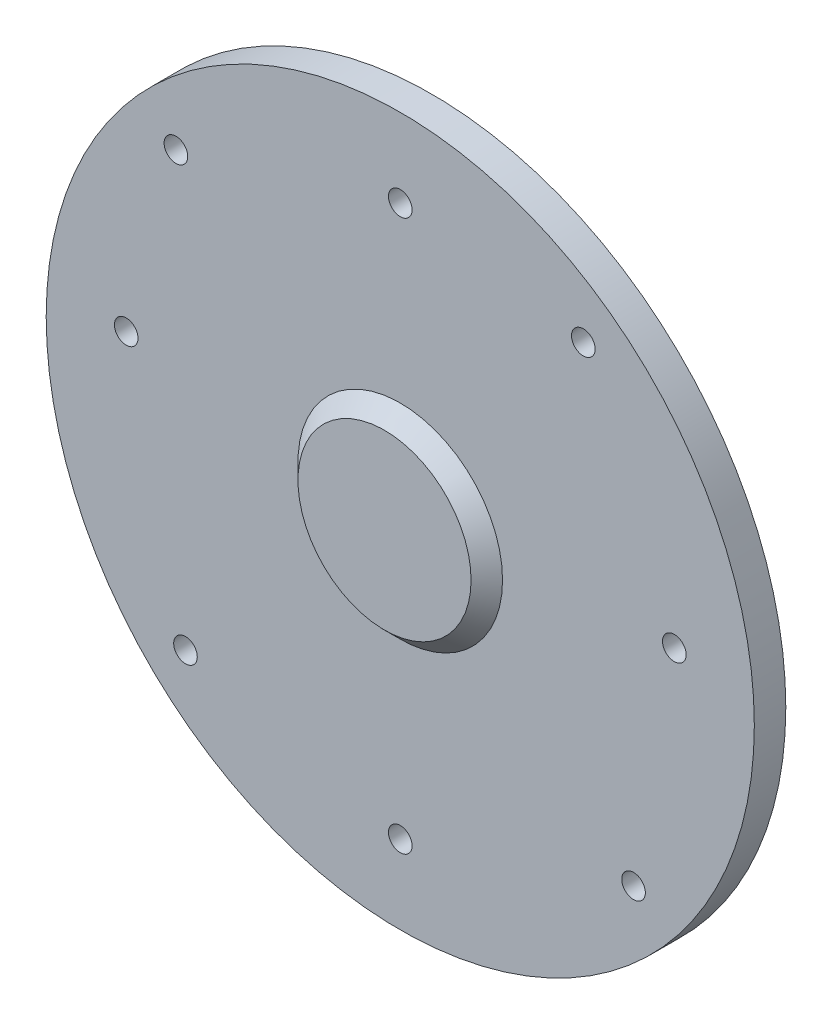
ISO-10303-21;
HEADER;
FILE_DESCRIPTION(('STEP AP214'),'2;1');
FILE_NAME('part.step','',(''),(''),'','','');
FILE_SCHEMA(('AUTOMOTIVE_DESIGN { 1 0 10303 214 1 1 1 1 }'));
ENDSEC;
DATA;
#1=APPLICATION_CONTEXT('core data for automotive mechanical design processes');
#2=APPLICATION_PROTOCOL_DEFINITION('international standard','automotive_design',2000,#1);
#3=PRODUCT_CONTEXT('',#1,'mechanical');
#4=PRODUCT('Part','Part','',(#3));
#5=PRODUCT_RELATED_PRODUCT_CATEGORY('part','',(#4));
#6=PRODUCT_DEFINITION_FORMATION('','',#4);
#7=PRODUCT_DEFINITION_CONTEXT('part definition',#1,'design');
#8=PRODUCT_DEFINITION('design','',#6,#7);
#9=PRODUCT_DEFINITION_SHAPE('','',#8);
#10=(LENGTH_UNIT() NAMED_UNIT(*) SI_UNIT(.MILLI.,.METRE.));
#11=(NAMED_UNIT(*) PLANE_ANGLE_UNIT() SI_UNIT($,.RADIAN.));
#12=(NAMED_UNIT(*) SI_UNIT($,.STERADIAN.) SOLID_ANGLE_UNIT());
#13=UNCERTAINTY_MEASURE_WITH_UNIT(LENGTH_MEASURE(1.E-05),#10,'distance_accuracy_value','');
#14=(GEOMETRIC_REPRESENTATION_CONTEXT(3) GLOBAL_UNCERTAINTY_ASSIGNED_CONTEXT((#13)) GLOBAL_UNIT_ASSIGNED_CONTEXT((#10,
#11,#12)) REPRESENTATION_CONTEXT('',''));
#15=CARTESIAN_POINT('',(0.,0.,0.));
#16=DIRECTION('',(0.,0.,1.));
#17=DIRECTION('',(1.,0.,0.));
#18=AXIS2_PLACEMENT_3D('',#15,#16,#17);
#19=CARTESIAN_POINT('',(0.,0.,-1.));
#20=DIRECTION('',(0.,0.,-1.));
#21=DIRECTION('',(-1.,0.,0.));
#22=AXIS2_PLACEMENT_3D('',#19,#20,#21);
#23=PLANE('',#22);
#24=CARTESIAN_POINT('',(0.,0.,-1.));
#25=DIRECTION('',(0.,0.,-1.));
#26=DIRECTION('',(-1.,0.,0.));
#27=AXIS2_PLACEMENT_3D('',#24,#25,#26);
#28=CIRCLE('',#27,5.5);
#29=CARTESIAN_POINT('',(-5.5,0.,-1.));
#30=VERTEX_POINT('',#29);
#31=EDGE_CURVE('E55',#30,#30,#28,.T.);
#32=ORIENTED_EDGE('',*,*,#31,.T.);
#33=EDGE_LOOP('',(#32));
#34=FACE_BOUND('',#33,.T.);
#35=CARTESIAN_POINT('',(0.,0.,-1.));
#36=DIRECTION('',(0.,0.,-1.));
#37=DIRECTION('',(-1.,0.,0.));
#38=AXIS2_PLACEMENT_3D('',#35,#36,#37);
#39=CIRCLE('',#38,5.);
#40=CARTESIAN_POINT('',(-5.,0.,-1.));
#41=VERTEX_POINT('',#40);
#42=EDGE_CURVE('E59',#41,#41,#39,.T.);
#43=ORIENTED_EDGE('',*,*,#42,.F.);
#44=EDGE_LOOP('',(#43));
#45=FACE_BOUND('',#44,.T.);
#46=ADVANCED_FACE('F32',(#34,#45),#23,.T.);
#47=CARTESIAN_POINT('',(0.,0.,0.));
#48=DIRECTION('',(0.,0.,1.));
#49=DIRECTION('',(1.,0.,0.));
#50=AXIS2_PLACEMENT_3D('',#47,#48,#49);
#51=PLANE('',#50);
#52=CARTESIAN_POINT('',(-13.6482975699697,-13.9274539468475,0.));
#53=DIRECTION('',(0.,0.,1.));
#54=DIRECTION('',(1.,0.,0.));
#55=AXIS2_PLACEMENT_3D('',#52,#53,#54);
#56=CIRCLE('',#55,0.75);
#57=CARTESIAN_POINT('',(-12.8982975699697,-13.9274539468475,0.));
#58=VERTEX_POINT('',#57);
#59=EDGE_CURVE('E109',#58,#58,#56,.T.);
#60=ORIENTED_EDGE('',*,*,#59,.T.);
#61=EDGE_LOOP('',(#60));
#62=FACE_BOUND('',#61,.T.);
#63=CARTESIAN_POINT('',(14.823494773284,-12.6694120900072,0.));
#64=DIRECTION('',(0.,0.,1.));
#65=DIRECTION('',(1.,0.,0.));
#66=AXIS2_PLACEMENT_3D('',#63,#64,#65);
#67=CIRCLE('',#66,0.75);
#68=CARTESIAN_POINT('',(15.573494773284,-12.6694120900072,0.));
#69=VERTEX_POINT('',#68);
#70=EDGE_CURVE('E103',#69,#69,#67,.T.);
#71=ORIENTED_EDGE('',*,*,#70,.T.);
#72=EDGE_LOOP('',(#71));
#73=FACE_BOUND('',#72,.T.);
#74=CARTESIAN_POINT('',(11.6318489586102,15.6508814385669,0.));
#75=DIRECTION('',(0.,0.,1.));
#76=DIRECTION('',(1.,0.,0.));
#77=AXIS2_PLACEMENT_3D('',#74,#75,#76);
#78=CIRCLE('',#77,0.75);
#79=CARTESIAN_POINT('',(12.3818489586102,15.6508814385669,0.));
#80=VERTEX_POINT('',#79);
#81=EDGE_CURVE('E97',#80,#80,#78,.T.);
#82=ORIENTED_EDGE('',*,*,#81,.T.);
#83=EDGE_LOOP('',(#82));
#84=FACE_BOUND('',#83,.T.);
#85=CARTESIAN_POINT('',(-14.2567540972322,13.3039453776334,0.));
#86=DIRECTION('',(0.,0.,1.));
#87=DIRECTION('',(1.,0.,0.));
#88=AXIS2_PLACEMENT_3D('',#85,#86,#87);
#89=CIRCLE('',#88,0.75);
#90=CARTESIAN_POINT('',(-13.5067540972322,13.3039453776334,0.));
#91=VERTEX_POINT('',#90);
#92=EDGE_CURVE('E91',#91,#91,#89,.T.);
#93=ORIENTED_EDGE('',*,*,#92,.T.);
#94=EDGE_LOOP('',(#93));
#95=FACE_BOUND('',#94,.T.);
#96=CARTESIAN_POINT('',(17.4149826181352,1.72289883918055,0.));
#97=DIRECTION('',(0.,0.,1.));
#98=DIRECTION('',(1.,0.,0.));
#99=AXIS2_PLACEMENT_3D('',#96,#97,#98);
#100=CIRCLE('',#99,0.750000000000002);
#101=CARTESIAN_POINT('',(18.1649826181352,1.72289883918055,0.));
#102=VERTEX_POINT('',#101);
#103=EDGE_CURVE('E85',#102,#102,#100,.T.);
#104=ORIENTED_EDGE('',*,*,#103,.T.);
#105=EDGE_LOOP('',(#104));
#106=FACE_BOUND('',#105,.T.);
#107=CARTESIAN_POINT('',(0.,-17.5,0.));
#108=DIRECTION('',(0.,0.,1.));
#109=DIRECTION('',(1.,0.,0.));
#110=AXIS2_PLACEMENT_3D('',#107,#108,#109);
#111=CIRCLE('',#110,0.75);
#112=CARTESIAN_POINT('',(0.75,-17.5,0.));
#113=VERTEX_POINT('',#112);
#114=EDGE_CURVE('E79',#113,#113,#111,.T.);
#115=ORIENTED_EDGE('',*,*,#114,.T.);
#116=EDGE_LOOP('',(#115));
#117=FACE_BOUND('',#116,.T.);
#118=CARTESIAN_POINT('',(-17.4149826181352,1.72289883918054,0.));
#119=DIRECTION('',(0.,0.,1.));
#120=DIRECTION('',(1.,0.,0.));
#121=AXIS2_PLACEMENT_3D('',#118,#119,#120);
#122=CIRCLE('',#121,0.750000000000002);
#123=CARTESIAN_POINT('',(-16.6649826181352,1.72289883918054,0.));
#124=VERTEX_POINT('',#123);
#125=EDGE_CURVE('E73',#124,#124,#122,.T.);
#126=ORIENTED_EDGE('',*,*,#125,.T.);
#127=EDGE_LOOP('',(#126));
#128=FACE_BOUND('',#127,.T.);
#129=CARTESIAN_POINT('',(0.,17.5,0.));
#130=DIRECTION('',(0.,0.,1.));
#131=DIRECTION('',(1.,0.,0.));
#132=AXIS2_PLACEMENT_3D('',#129,#130,#131);
#133=CIRCLE('',#132,0.75);
#134=CARTESIAN_POINT('',(0.75,17.5,0.));
#135=VERTEX_POINT('',#134);
#136=EDGE_CURVE('E67',#135,#135,#133,.T.);
#137=ORIENTED_EDGE('',*,*,#136,.T.);
#138=EDGE_LOOP('',(#137));
#139=FACE_BOUND('',#138,.T.);
#140=CARTESIAN_POINT('',(0.,0.,0.));
#141=DIRECTION('',(0.,0.,1.));
#142=DIRECTION('',(1.,0.,0.));
#143=AXIS2_PLACEMENT_3D('',#140,#141,#142);
#144=CIRCLE('',#143,22.5);
#145=CARTESIAN_POINT('',(22.5,0.,0.));
#146=VERTEX_POINT('',#145);
#147=EDGE_CURVE('E43',#146,#146,#144,.T.);
#148=ORIENTED_EDGE('',*,*,#147,.F.);
#149=EDGE_LOOP('',(#148));
#150=FACE_BOUND('',#149,.T.);
#151=CARTESIAN_POINT('',(0.,0.,0.));
#152=DIRECTION('',(0.,0.,1.));
#153=DIRECTION('',(1.,0.,0.));
#154=AXIS2_PLACEMENT_3D('',#151,#152,#153);
#155=CIRCLE('',#154,6.5);
#156=CARTESIAN_POINT('',(6.5,0.,0.));
#157=VERTEX_POINT('',#156);
#158=EDGE_CURVE('E10',#157,#157,#155,.F.);
#159=ORIENTED_EDGE('',*,*,#158,.F.);
#160=EDGE_LOOP('',(#159));
#161=FACE_BOUND('',#160,.T.);
#162=ADVANCED_FACE('F152',(#62,#73,#84,#95,#106,#117,#128,#139,#150,#161),#51,.F.);
#163=CARTESIAN_POINT('',(0.,0.,2.));
#164=DIRECTION('',(0.,0.,1.));
#165=DIRECTION('',(1.,0.,0.));
#166=AXIS2_PLACEMENT_3D('',#163,#164,#165);
#167=PLANE('',#166);
#168=CARTESIAN_POINT('',(-13.6482975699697,-13.9274539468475,2.));
#169=DIRECTION('',(0.,0.,1.));
#170=DIRECTION('',(1.,0.,0.));
#171=AXIS2_PLACEMENT_3D('',#168,#169,#170);
#172=CIRCLE('',#171,0.75);
#173=CARTESIAN_POINT('',(-12.8982975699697,-13.9274539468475,2.));
#174=VERTEX_POINT('',#173);
#175=EDGE_CURVE('E112',#174,#174,#172,.T.);
#176=ORIENTED_EDGE('',*,*,#175,.F.);
#177=EDGE_LOOP('',(#176));
#178=FACE_BOUND('',#177,.T.);
#179=CARTESIAN_POINT('',(14.823494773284,-12.6694120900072,2.));
#180=DIRECTION('',(0.,0.,1.));
#181=DIRECTION('',(1.,0.,0.));
#182=AXIS2_PLACEMENT_3D('',#179,#180,#181);
#183=CIRCLE('',#182,0.75);
#184=CARTESIAN_POINT('',(15.573494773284,-12.6694120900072,2.));
#185=VERTEX_POINT('',#184);
#186=EDGE_CURVE('E106',#185,#185,#183,.T.);
#187=ORIENTED_EDGE('',*,*,#186,.F.);
#188=EDGE_LOOP('',(#187));
#189=FACE_BOUND('',#188,.T.);
#190=CARTESIAN_POINT('',(11.6318489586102,15.6508814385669,2.));
#191=DIRECTION('',(0.,0.,1.));
#192=DIRECTION('',(1.,0.,0.));
#193=AXIS2_PLACEMENT_3D('',#190,#191,#192);
#194=CIRCLE('',#193,0.75);
#195=CARTESIAN_POINT('',(12.3818489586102,15.6508814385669,2.));
#196=VERTEX_POINT('',#195);
#197=EDGE_CURVE('E100',#196,#196,#194,.T.);
#198=ORIENTED_EDGE('',*,*,#197,.F.);
#199=EDGE_LOOP('',(#198));
#200=FACE_BOUND('',#199,.T.);
#201=CARTESIAN_POINT('',(-14.2567540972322,13.3039453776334,2.));
#202=DIRECTION('',(0.,0.,1.));
#203=DIRECTION('',(1.,0.,0.));
#204=AXIS2_PLACEMENT_3D('',#201,#202,#203);
#205=CIRCLE('',#204,0.75);
#206=CARTESIAN_POINT('',(-13.5067540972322,13.3039453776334,2.));
#207=VERTEX_POINT('',#206);
#208=EDGE_CURVE('E94',#207,#207,#205,.T.);
#209=ORIENTED_EDGE('',*,*,#208,.F.);
#210=EDGE_LOOP('',(#209));
#211=FACE_BOUND('',#210,.T.);
#212=CARTESIAN_POINT('',(17.4149826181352,1.72289883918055,2.));
#213=DIRECTION('',(0.,0.,1.));
#214=DIRECTION('',(1.,0.,0.));
#215=AXIS2_PLACEMENT_3D('',#212,#213,#214);
#216=CIRCLE('',#215,0.750000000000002);
#217=CARTESIAN_POINT('',(18.1649826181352,1.72289883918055,2.));
#218=VERTEX_POINT('',#217);
#219=EDGE_CURVE('E88',#218,#218,#216,.T.);
#220=ORIENTED_EDGE('',*,*,#219,.F.);
#221=EDGE_LOOP('',(#220));
#222=FACE_BOUND('',#221,.T.);
#223=CARTESIAN_POINT('',(0.,-17.5,2.));
#224=DIRECTION('',(0.,0.,1.));
#225=DIRECTION('',(1.,0.,0.));
#226=AXIS2_PLACEMENT_3D('',#223,#224,#225);
#227=CIRCLE('',#226,0.75);
#228=CARTESIAN_POINT('',(0.75,-17.5,2.));
#229=VERTEX_POINT('',#228);
#230=EDGE_CURVE('E82',#229,#229,#227,.T.);
#231=ORIENTED_EDGE('',*,*,#230,.F.);
#232=EDGE_LOOP('',(#231));
#233=FACE_BOUND('',#232,.T.);
#234=CARTESIAN_POINT('',(-17.4149826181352,1.72289883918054,2.));
#235=DIRECTION('',(0.,0.,1.));
#236=DIRECTION('',(1.,0.,0.));
#237=AXIS2_PLACEMENT_3D('',#234,#235,#236);
#238=CIRCLE('',#237,0.750000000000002);
#239=CARTESIAN_POINT('',(-16.6649826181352,1.72289883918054,2.));
#240=VERTEX_POINT('',#239);
#241=EDGE_CURVE('E76',#240,#240,#238,.T.);
#242=ORIENTED_EDGE('',*,*,#241,.F.);
#243=EDGE_LOOP('',(#242));
#244=FACE_BOUND('',#243,.T.);
#245=CARTESIAN_POINT('',(0.,17.5,2.));
#246=DIRECTION('',(0.,0.,1.));
#247=DIRECTION('',(1.,0.,0.));
#248=AXIS2_PLACEMENT_3D('',#245,#246,#247);
#249=CIRCLE('',#248,0.75);
#250=CARTESIAN_POINT('',(0.75,17.5,2.));
#251=VERTEX_POINT('',#250);
#252=EDGE_CURVE('E70',#251,#251,#249,.T.);
#253=ORIENTED_EDGE('',*,*,#252,.F.);
#254=EDGE_LOOP('',(#253));
#255=FACE_BOUND('',#254,.T.);
#256=CARTESIAN_POINT('',(0.,0.,2.));
#257=DIRECTION('',(0.,0.,1.));
#258=DIRECTION('',(1.,0.,0.));
#259=AXIS2_PLACEMENT_3D('',#256,#257,#258);
#260=CIRCLE('',#259,22.5);
#261=CARTESIAN_POINT('',(22.5,0.,2.));
#262=VERTEX_POINT('',#261);
#263=EDGE_CURVE('E39',#262,#262,#260,.T.);
#264=ORIENTED_EDGE('',*,*,#263,.T.);
#265=EDGE_LOOP('',(#264));
#266=FACE_BOUND('',#265,.T.);
#267=CARTESIAN_POINT('',(0.,0.,2.));
#268=DIRECTION('',(0.,0.,1.));
#269=DIRECTION('',(1.,0.,0.));
#270=AXIS2_PLACEMENT_3D('',#267,#268,#269);
#271=CIRCLE('',#270,6.5);
#272=CARTESIAN_POINT('',(6.5,0.,2.));
#273=VERTEX_POINT('',#272);
#274=EDGE_CURVE('E52',#273,#273,#271,.T.);
#275=ORIENTED_EDGE('',*,*,#274,.F.);
#276=EDGE_LOOP('',(#275));
#277=FACE_BOUND('',#276,.T.);
#278=ADVANCED_FACE('F158',(#178,#189,#200,#211,#222,#233,#244,#255,#266,#277),#167,.T.);
#279=CARTESIAN_POINT('',(0.,0.,2.));
#280=DIRECTION('',(0.,0.,-1.));
#281=DIRECTION('',(-1.,0.,0.));
#282=AXIS2_PLACEMENT_3D('',#279,#280,#281);
#283=CYLINDRICAL_SURFACE('',#282,22.5);
#284=ORIENTED_EDGE('',*,*,#263,.F.);
#285=EDGE_LOOP('',(#284));
#286=FACE_BOUND('',#285,.T.);
#287=ORIENTED_EDGE('',*,*,#147,.T.);
#288=EDGE_LOOP('',(#287));
#289=FACE_BOUND('',#288,.T.);
#290=ADVANCED_FACE('F34',(#286,#289),#283,.T.);
#291=CARTESIAN_POINT('',(0.,0.,2.));
#292=DIRECTION('',(0.,0.,-1.));
#293=DIRECTION('',(1.,0.,0.));
#294=AXIS2_PLACEMENT_3D('',#291,#292,#293);
#295=CONICAL_SURFACE('',#294,6.5,0.78539816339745);
#296=CARTESIAN_POINT('',(0.,0.,3.));
#297=DIRECTION('',(0.,0.,1.));
#298=DIRECTION('',(1.,0.,0.));
#299=AXIS2_PLACEMENT_3D('',#296,#297,#298);
#300=CIRCLE('',#299,5.5);
#301=CARTESIAN_POINT('',(5.5,0.,3.));
#302=VERTEX_POINT('',#301);
#303=EDGE_CURVE('E48',#302,#302,#300,.T.);
#304=ORIENTED_EDGE('',*,*,#303,.F.);
#305=EDGE_LOOP('',(#304));
#306=FACE_BOUND('',#305,.T.);
#307=ORIENTED_EDGE('',*,*,#274,.T.);
#308=EDGE_LOOP('',(#307));
#309=FACE_BOUND('',#308,.T.);
#310=ADVANCED_FACE('F167',(#306,#309),#295,.T.);
#311=CARTESIAN_POINT('',(0.,0.,3.));
#312=DIRECTION('',(0.,0.,1.));
#313=DIRECTION('',(1.,0.,0.));
#314=AXIS2_PLACEMENT_3D('',#311,#312,#313);
#315=PLANE('',#314);
#316=ORIENTED_EDGE('',*,*,#303,.T.);
#317=EDGE_LOOP('',(#316));
#318=FACE_BOUND('',#317,.T.);
#319=ADVANCED_FACE('F163',(#318),#315,.T.);
#320=CARTESIAN_POINT('',(0.,0.,0.));
#321=DIRECTION('',(0.,0.,1.));
#322=DIRECTION('',(-1.,0.,0.));
#323=AXIS2_PLACEMENT_3D('',#320,#321,#322);
#324=CONICAL_SURFACE('',#323,6.5,0.78539816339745);
#325=ORIENTED_EDGE('',*,*,#31,.F.);
#326=EDGE_LOOP('',(#325));
#327=FACE_BOUND('',#326,.T.);
#328=ORIENTED_EDGE('',*,*,#158,.T.);
#329=EDGE_LOOP('',(#328));
#330=FACE_BOUND('',#329,.T.);
#331=ADVANCED_FACE('F147',(#327,#330),#324,.T.);
#332=CARTESIAN_POINT('',(0.,0.,-2.));
#333=DIRECTION('',(0.,0.,1.));
#334=DIRECTION('',(1.,0.,0.));
#335=AXIS2_PLACEMENT_3D('',#332,#333,#334);
#336=CYLINDRICAL_SURFACE('',#335,5.);
#337=CARTESIAN_POINT('',(0.,0.,-2.));
#338=DIRECTION('',(0.,0.,-1.));
#339=DIRECTION('',(-1.,0.,0.));
#340=AXIS2_PLACEMENT_3D('',#337,#338,#339);
#341=CIRCLE('',#340,5.);
#342=CARTESIAN_POINT('',(-5.,0.,-2.));
#343=VERTEX_POINT('',#342);
#344=EDGE_CURVE('E58',#343,#343,#341,.T.);
#345=ORIENTED_EDGE('',*,*,#344,.F.);
#346=EDGE_LOOP('',(#345));
#347=FACE_BOUND('',#346,.T.);
#348=ORIENTED_EDGE('',*,*,#42,.T.);
#349=EDGE_LOOP('',(#348));
#350=FACE_BOUND('',#349,.T.);
#351=ADVANCED_FACE('F141',(#347,#350),#336,.T.);
#352=CARTESIAN_POINT('',(0.,0.,-2.));
#353=DIRECTION('',(0.,0.,1.));
#354=DIRECTION('',(-1.,0.,0.));
#355=AXIS2_PLACEMENT_3D('',#352,#353,#354);
#356=CONICAL_SURFACE('',#355,5.,0.78539816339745);
#357=CARTESIAN_POINT('',(0.,0.,-3.5));
#358=DIRECTION('',(0.,0.,-1.));
#359=DIRECTION('',(-1.,0.,0.));
#360=AXIS2_PLACEMENT_3D('',#357,#358,#359);
#361=CIRCLE('',#360,3.49999999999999);
#362=CARTESIAN_POINT('',(-3.49999999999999,0.,-3.5));
#363=VERTEX_POINT('',#362);
#364=EDGE_CURVE('E62',#363,#363,#361,.T.);
#365=ORIENTED_EDGE('',*,*,#364,.F.);
#366=EDGE_LOOP('',(#365));
#367=FACE_BOUND('',#366,.T.);
#368=ORIENTED_EDGE('',*,*,#344,.T.);
#369=EDGE_LOOP('',(#368));
#370=FACE_BOUND('',#369,.T.);
#371=ADVANCED_FACE('F135',(#367,#370),#356,.T.);
#372=CARTESIAN_POINT('',(0.,0.,-3.5));
#373=DIRECTION('',(0.,0.,-1.));
#374=DIRECTION('',(-1.,0.,0.));
#375=AXIS2_PLACEMENT_3D('',#372,#373,#374);
#376=PLANE('',#375);
#377=CARTESIAN_POINT('',(0.,0.,-3.5));
#378=DIRECTION('',(0.,0.,-1.));
#379=DIRECTION('',(-1.,0.,0.));
#380=AXIS2_PLACEMENT_3D('',#377,#378,#379);
#381=CIRCLE('',#380,2.9);
#382=CARTESIAN_POINT('',(-2.9,0.,-3.5));
#383=VERTEX_POINT('',#382);
#384=EDGE_CURVE('E116',#383,#383,#381,.T.);
#385=ORIENTED_EDGE('',*,*,#384,.F.);
#386=EDGE_LOOP('',(#385));
#387=FACE_BOUND('',#386,.T.);
#388=ORIENTED_EDGE('',*,*,#364,.T.);
#389=EDGE_LOOP('',(#388));
#390=FACE_BOUND('',#389,.T.);
#391=ADVANCED_FACE('F131',(#387,#390),#376,.T.);
#392=CARTESIAN_POINT('',(0.,17.5,-3.5));
#393=DIRECTION('',(0.,0.,1.));
#394=DIRECTION('',(1.,0.,0.));
#395=AXIS2_PLACEMENT_3D('',#392,#393,#394);
#396=CYLINDRICAL_SURFACE('',#395,0.75);
#397=ORIENTED_EDGE('',*,*,#252,.T.);
#398=EDGE_LOOP('',(#397));
#399=FACE_BOUND('',#398,.T.);
#400=ORIENTED_EDGE('',*,*,#136,.F.);
#401=EDGE_LOOP('',(#400));
#402=FACE_BOUND('',#401,.T.);
#403=ADVANCED_FACE('F134',(#399,#402),#396,.F.);
#404=CARTESIAN_POINT('',(-17.4149826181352,1.72289883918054,-3.5));
#405=DIRECTION('',(0.,0.,1.));
#406=DIRECTION('',(1.,0.,0.));
#407=AXIS2_PLACEMENT_3D('',#404,#405,#406);
#408=CYLINDRICAL_SURFACE('',#407,0.750000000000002);
#409=ORIENTED_EDGE('',*,*,#241,.T.);
#410=EDGE_LOOP('',(#409));
#411=FACE_BOUND('',#410,.T.);
#412=ORIENTED_EDGE('',*,*,#125,.F.);
#413=EDGE_LOOP('',(#412));
#414=FACE_BOUND('',#413,.T.);
#415=ADVANCED_FACE('F199',(#411,#414),#408,.F.);
#416=CARTESIAN_POINT('',(0.,-17.5,-3.5));
#417=DIRECTION('',(0.,0.,1.));
#418=DIRECTION('',(1.,0.,0.));
#419=AXIS2_PLACEMENT_3D('',#416,#417,#418);
#420=CYLINDRICAL_SURFACE('',#419,0.75);
#421=ORIENTED_EDGE('',*,*,#230,.T.);
#422=EDGE_LOOP('',(#421));
#423=FACE_BOUND('',#422,.T.);
#424=ORIENTED_EDGE('',*,*,#114,.F.);
#425=EDGE_LOOP('',(#424));
#426=FACE_BOUND('',#425,.T.);
#427=ADVANCED_FACE('F210',(#423,#426),#420,.F.);
#428=CARTESIAN_POINT('',(17.4149826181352,1.72289883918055,-3.5));
#429=DIRECTION('',(0.,0.,1.));
#430=DIRECTION('',(1.,0.,0.));
#431=AXIS2_PLACEMENT_3D('',#428,#429,#430);
#432=CYLINDRICAL_SURFACE('',#431,0.750000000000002);
#433=ORIENTED_EDGE('',*,*,#219,.T.);
#434=EDGE_LOOP('',(#433));
#435=FACE_BOUND('',#434,.T.);
#436=ORIENTED_EDGE('',*,*,#103,.F.);
#437=EDGE_LOOP('',(#436));
#438=FACE_BOUND('',#437,.T.);
#439=ADVANCED_FACE('F216',(#435,#438),#432,.F.);
#440=CARTESIAN_POINT('',(-14.2567540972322,13.3039453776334,-3.5));
#441=DIRECTION('',(0.,0.,1.));
#442=DIRECTION('',(1.,0.,0.));
#443=AXIS2_PLACEMENT_3D('',#440,#441,#442);
#444=CYLINDRICAL_SURFACE('',#443,0.75);
#445=ORIENTED_EDGE('',*,*,#208,.T.);
#446=EDGE_LOOP('',(#445));
#447=FACE_BOUND('',#446,.T.);
#448=ORIENTED_EDGE('',*,*,#92,.F.);
#449=EDGE_LOOP('',(#448));
#450=FACE_BOUND('',#449,.T.);
#451=ADVANCED_FACE('F220',(#447,#450),#444,.F.);
#452=CARTESIAN_POINT('',(11.6318489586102,15.6508814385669,-3.5));
#453=DIRECTION('',(0.,0.,1.));
#454=DIRECTION('',(1.,0.,0.));
#455=AXIS2_PLACEMENT_3D('',#452,#453,#454);
#456=CYLINDRICAL_SURFACE('',#455,0.75);
#457=ORIENTED_EDGE('',*,*,#197,.T.);
#458=EDGE_LOOP('',(#457));
#459=FACE_BOUND('',#458,.T.);
#460=ORIENTED_EDGE('',*,*,#81,.F.);
#461=EDGE_LOOP('',(#460));
#462=FACE_BOUND('',#461,.T.);
#463=ADVANCED_FACE('F224',(#459,#462),#456,.F.);
#464=CARTESIAN_POINT('',(14.823494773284,-12.6694120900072,-3.5));
#465=DIRECTION('',(0.,0.,1.));
#466=DIRECTION('',(1.,0.,0.));
#467=AXIS2_PLACEMENT_3D('',#464,#465,#466);
#468=CYLINDRICAL_SURFACE('',#467,0.75);
#469=ORIENTED_EDGE('',*,*,#186,.T.);
#470=EDGE_LOOP('',(#469));
#471=FACE_BOUND('',#470,.T.);
#472=ORIENTED_EDGE('',*,*,#70,.F.);
#473=EDGE_LOOP('',(#472));
#474=FACE_BOUND('',#473,.T.);
#475=ADVANCED_FACE('F228',(#471,#474),#468,.F.);
#476=CARTESIAN_POINT('',(-13.6482975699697,-13.9274539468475,-3.5));
#477=DIRECTION('',(0.,0.,1.));
#478=DIRECTION('',(1.,0.,0.));
#479=AXIS2_PLACEMENT_3D('',#476,#477,#478);
#480=CYLINDRICAL_SURFACE('',#479,0.75);
#481=ORIENTED_EDGE('',*,*,#175,.T.);
#482=EDGE_LOOP('',(#481));
#483=FACE_BOUND('',#482,.T.);
#484=ORIENTED_EDGE('',*,*,#59,.F.);
#485=EDGE_LOOP('',(#484));
#486=FACE_BOUND('',#485,.T.);
#487=ADVANCED_FACE('F127',(#483,#486),#480,.F.);
#488=CARTESIAN_POINT('',(0.,0.,-0.8));
#489=DIRECTION('',(0.,0.,-1.));
#490=DIRECTION('',(-1.,0.,0.));
#491=AXIS2_PLACEMENT_3D('',#488,#489,#490);
#492=CYLINDRICAL_SURFACE('',#491,2.9);
#493=CARTESIAN_POINT('',(0.,0.,-0.8));
#494=DIRECTION('',(0.,0.,-1.));
#495=DIRECTION('',(-1.,0.,0.));
#496=AXIS2_PLACEMENT_3D('',#493,#494,#495);
#497=CIRCLE('',#496,2.9);
#498=CARTESIAN_POINT('',(-2.9,0.,-0.8));
#499=VERTEX_POINT('',#498);
#500=EDGE_CURVE('E115',#499,#499,#497,.T.);
#501=CARTESIAN_POINT('',(-2.9,0.,-0.8));
#502=CARTESIAN_POINT('',(-2.9,0.,-0.828125));
#503=CARTESIAN_POINT('',(-2.9,0.,-0.85625));
#504=CARTESIAN_POINT('',(-2.9,0.,-0.9125));
#505=CARTESIAN_POINT('',(-2.9,0.,-0.940625));
#506=CARTESIAN_POINT('',(-2.9,0.,-0.996875));
#507=CARTESIAN_POINT('',(-2.9,0.,-1.025));
#508=CARTESIAN_POINT('',(-2.9,0.,-1.08125));
#509=CARTESIAN_POINT('',(-2.9,0.,-1.109375));
#510=CARTESIAN_POINT('',(-2.9,0.,-1.165625));
#511=CARTESIAN_POINT('',(-2.9,0.,-1.19375));
#512=CARTESIAN_POINT('',(-2.9,0.,-1.25));
#513=CARTESIAN_POINT('',(-2.9,0.,-1.278125));
#514=CARTESIAN_POINT('',(-2.9,0.,-1.334375));
#515=CARTESIAN_POINT('',(-2.9,0.,-1.3625));
#516=CARTESIAN_POINT('',(-2.9,0.,-1.41875));
#517=CARTESIAN_POINT('',(-2.9,0.,-1.446875));
#518=CARTESIAN_POINT('',(-2.9,0.,-1.503125));
#519=CARTESIAN_POINT('',(-2.9,0.,-1.53125));
#520=CARTESIAN_POINT('',(-2.9,0.,-1.5875));
#521=CARTESIAN_POINT('',(-2.9,0.,-1.615625));
#522=CARTESIAN_POINT('',(-2.9,0.,-1.671875));
#523=CARTESIAN_POINT('',(-2.9,0.,-1.7));
#524=CARTESIAN_POINT('',(-2.9,0.,-1.75625));
#525=CARTESIAN_POINT('',(-2.9,0.,-1.784375));
#526=CARTESIAN_POINT('',(-2.9,0.,-1.840625));
#527=CARTESIAN_POINT('',(-2.9,0.,-1.86875));
#528=CARTESIAN_POINT('',(-2.9,0.,-1.925));
#529=CARTESIAN_POINT('',(-2.9,0.,-1.953125));
#530=CARTESIAN_POINT('',(-2.9,0.,-2.009375));
#531=CARTESIAN_POINT('',(-2.9,0.,-2.0375));
#532=CARTESIAN_POINT('',(-2.9,0.,-2.09375));
#533=CARTESIAN_POINT('',(-2.9,0.,-2.121875));
#534=CARTESIAN_POINT('',(-2.9,0.,-2.178125));
#535=CARTESIAN_POINT('',(-2.9,0.,-2.20625));
#536=CARTESIAN_POINT('',(-2.9,0.,-2.2625));
#537=CARTESIAN_POINT('',(-2.9,0.,-2.290625));
#538=CARTESIAN_POINT('',(-2.9,0.,-2.346875));
#539=CARTESIAN_POINT('',(-2.9,0.,-2.375));
#540=CARTESIAN_POINT('',(-2.9,0.,-2.43125));
#541=CARTESIAN_POINT('',(-2.9,0.,-2.459375));
#542=CARTESIAN_POINT('',(-2.9,0.,-2.515625));
#543=CARTESIAN_POINT('',(-2.9,0.,-2.54375));
#544=CARTESIAN_POINT('',(-2.9,0.,-2.6));
#545=CARTESIAN_POINT('',(-2.9,0.,-2.628125));
#546=CARTESIAN_POINT('',(-2.9,0.,-2.684375));
#547=CARTESIAN_POINT('',(-2.9,0.,-2.7125));
#548=CARTESIAN_POINT('',(-2.9,0.,-2.76875));
#549=CARTESIAN_POINT('',(-2.9,0.,-2.796875));
#550=CARTESIAN_POINT('',(-2.9,0.,-2.853125));
#551=CARTESIAN_POINT('',(-2.9,0.,-2.88125));
#552=CARTESIAN_POINT('',(-2.9,0.,-2.9375));
#553=CARTESIAN_POINT('',(-2.9,0.,-2.965625));
#554=CARTESIAN_POINT('',(-2.9,0.,-3.021875));
#555=CARTESIAN_POINT('',(-2.9,0.,-3.05));
#556=CARTESIAN_POINT('',(-2.9,0.,-3.10625));
#557=CARTESIAN_POINT('',(-2.9,0.,-3.134375));
#558=CARTESIAN_POINT('',(-2.9,0.,-3.190625));
#559=CARTESIAN_POINT('',(-2.9,0.,-3.21875));
#560=CARTESIAN_POINT('',(-2.9,0.,-3.275));
#561=CARTESIAN_POINT('',(-2.9,0.,-3.303125));
#562=CARTESIAN_POINT('',(-2.9,0.,-3.359375));
#563=CARTESIAN_POINT('',(-2.9,0.,-3.3875));
#564=CARTESIAN_POINT('',(-2.9,0.,-3.44375));
#565=CARTESIAN_POINT('',(-2.9,0.,-3.471875));
#566=CARTESIAN_POINT('',(-2.9,0.,-3.5));
#567=B_SPLINE_CURVE_WITH_KNOTS('',3,(#501,#502,#503,#504,#505,#506,#507,#508,#509,#510,#511,
#512,#513,#514,#515,#516,#517,#518,#519,#520,#521,#522,#523,#524,#525,#526,#527,#528,#529,#530,
#531,#532,#533,#534,#535,#536,#537,#538,#539,#540,#541,#542,#543,#544,#545,#546,#547,#548,#549,
#550,#551,#552,#553,#554,#555,#556,#557,#558,#559,#560,#561,#562,#563,#564,#565,#566),
.UNSPECIFIED.,.F.,.F.,(4,2,2,2,2,2,2,2,2,2,2,2,2,2,2,2,2,2,2,2,2,2,2,2,2,2,2,2,2,2,2,2,4),(0.,
0.0843749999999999,0.16875,0.253125,0.3375,0.421875,0.50625,0.590625,0.675,0.759375,0.84375,
0.928125,1.0125,1.096875,1.18125,1.265625,1.35,1.434375,1.51875,1.603125,1.6875,1.771875,
1.85625,1.940625,2.025,2.109375,2.19375,2.278125,2.3625,2.446875,2.53125,2.615625,2.7),.UNSPECIFIED.);
#568=EDGE_CURVE('BSEAM124',#499,#383,#567,.T.);
#569=ORIENTED_EDGE('',*,*,#500,.F.);
#570=ORIENTED_EDGE('',*,*,#384,.T.);
#571=ORIENTED_EDGE('',*,*,#568,.T.);
#572=ORIENTED_EDGE('',*,*,#568,.F.);
#573=EDGE_LOOP('',(#569,#571,#570,#572));
#574=FACE_BOUND('',#573,.T.);
#575=ADVANCED_FACE('F124',(#574),#492,.F.);
#576=CARTESIAN_POINT('',(0.,0.,-0.8));
#577=DIRECTION('',(0.,0.,-1.));
#578=DIRECTION('',(-1.,0.,0.));
#579=AXIS2_PLACEMENT_3D('',#576,#577,#578);
#580=PLANE('',#579);
#581=ORIENTED_EDGE('',*,*,#500,.T.);
#582=EDGE_LOOP('',(#581));
#583=FACE_BOUND('',#582,.T.);
#584=ADVANCED_FACE('F122',(#583),#580,.T.);
#585=CLOSED_SHELL('',(#46,#162,#278,#290,#310,#319,#331,#351,#371,#391,#403,#415,#427,#439,#451,
#463,#475,#487,#575,#584));
#586=MANIFOLD_SOLID_BREP('B2',#585);
#587=ADVANCED_BREP_SHAPE_REPRESENTATION('',(#18,#586),#14);
#588=SHAPE_DEFINITION_REPRESENTATION(#9,#587);
ENDSEC;
END-ISO-10303-21;
